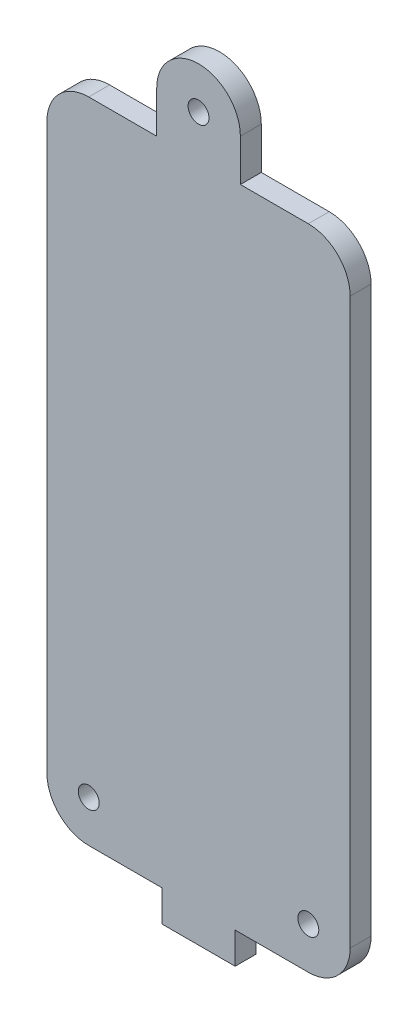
from build123d import *

# Parameters (mm, degrees)
EXTRUDE_1_DEPTH     = 2
SKETCH_2_R          = 1
CUT_EXTRUDE_1_DEPTH = 75.453005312


with BuildPart() as part:
    # Sketch 1 → Extrude 1 (new body)
    with BuildSketch(Plane.XY):
        with BuildLine():
            Line((3.5, 0), (-3.5, 0))
            Line((-3.5, 0), (-3.5, 3))
            Line((-3.5, 3), (-10.5, 3))
            ThreePointArc((-10.5, 3), (-13.328427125, 4.171572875), (-14.5, 7))
            Line((-14.5, 7), (-14.5, 61))
            ThreePointArc((-14.5, 61), (-13.328427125, 63.828427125), (-10.5, 65))
            Line((-10.5, 65), (-4, 65))
            Line((-4, 65), (-4, 69))
            ThreePointArc((-4, 69), (0, 73), (4, 69))
            Line((4, 69), (4, 65))
            Line((4, 65), (10.5, 65))
            ThreePointArc((10.5, 65), (13.328427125, 63.828427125), (14.5, 61))
            Line((14.5, 61), (14.5, 7))
            ThreePointArc((14.5, 7), (13.328427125, 4.171572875), (10.5, 3))
            Line((10.5, 3), (3.5, 3))
            Line((3.5, 3), (3.5, 0))
        make_face()
    extrude(amount=EXTRUDE_1_DEPTH)

    # Sketch 2 → Cut-Extrude 1 (cut, through all)
    with BuildSketch(Plane.XY.offset(2)):
        with Locations((0, 69)):
            Circle(SKETCH_2_R)
        with Locations((10.5, 7)):
            Circle(SKETCH_2_R)
        with Locations((-10.5, 7)):
            Circle(SKETCH_2_R)
    extrude(amount=-CUT_EXTRUDE_1_DEPTH, mode=Mode.SUBTRACT)


solid = part.part
